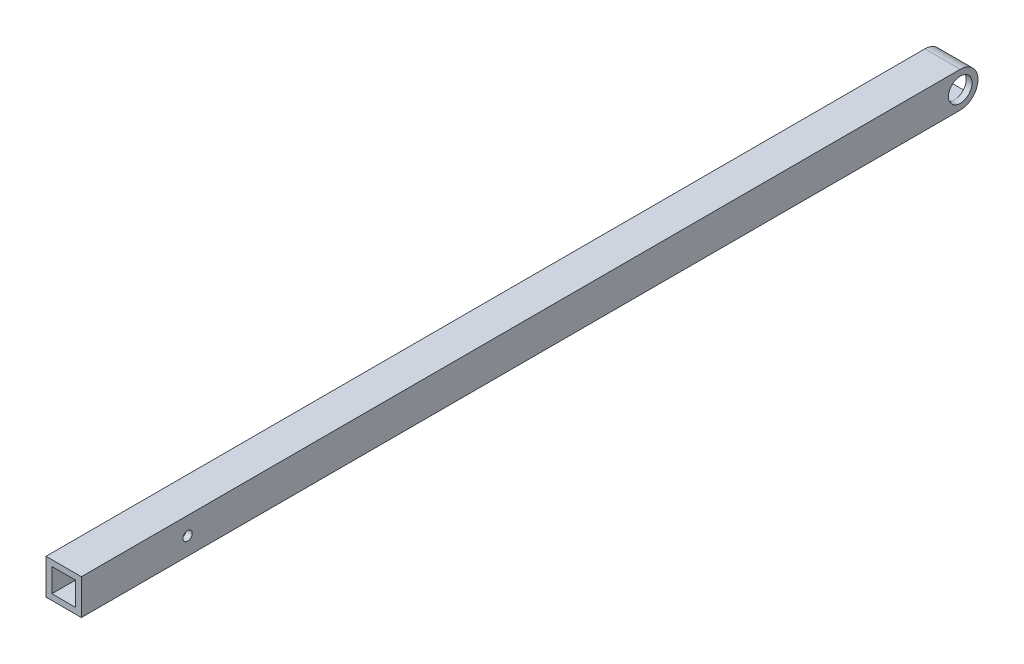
ISO-10303-21;
HEADER;
FILE_DESCRIPTION(('STEP AP214'),'2;1');
FILE_NAME('part.step','',(''),(''),'','','');
FILE_SCHEMA(('AUTOMOTIVE_DESIGN { 1 0 10303 214 1 1 1 1 }'));
ENDSEC;
DATA;
#1=APPLICATION_CONTEXT('core data for automotive mechanical design processes');
#2=APPLICATION_PROTOCOL_DEFINITION('international standard','automotive_design',2000,#1);
#3=PRODUCT_CONTEXT('',#1,'mechanical');
#4=PRODUCT('Part','Part','',(#3));
#5=PRODUCT_RELATED_PRODUCT_CATEGORY('part','',(#4));
#6=PRODUCT_DEFINITION_FORMATION('','',#4);
#7=PRODUCT_DEFINITION_CONTEXT('part definition',#1,'design');
#8=PRODUCT_DEFINITION('design','',#6,#7);
#9=PRODUCT_DEFINITION_SHAPE('','',#8);
#10=(LENGTH_UNIT() NAMED_UNIT(*) SI_UNIT(.MILLI.,.METRE.));
#11=(NAMED_UNIT(*) PLANE_ANGLE_UNIT() SI_UNIT($,.RADIAN.));
#12=(NAMED_UNIT(*) SI_UNIT($,.STERADIAN.) SOLID_ANGLE_UNIT());
#13=UNCERTAINTY_MEASURE_WITH_UNIT(LENGTH_MEASURE(1.E-05),#10,'distance_accuracy_value','');
#14=(GEOMETRIC_REPRESENTATION_CONTEXT(3) GLOBAL_UNCERTAINTY_ASSIGNED_CONTEXT((#13)) GLOBAL_UNIT_ASSIGNED_CONTEXT((#10,
#11,#12)) REPRESENTATION_CONTEXT('',''));
#15=CARTESIAN_POINT('',(0.,0.,0.));
#16=DIRECTION('',(0.,0.,1.));
#17=DIRECTION('',(1.,0.,0.));
#18=AXIS2_PLACEMENT_3D('',#15,#16,#17);
#19=CARTESIAN_POINT('',(9.525,-9.525,482.6));
#20=DIRECTION('',(-1.,0.,0.));
#21=DIRECTION('',(0.,0.,1.));
#22=AXIS2_PLACEMENT_3D('',#19,#20,#21);
#23=PLANE('',#22);
#24=CARTESIAN_POINT('',(9.525,0.,425.424599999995));
#25=DIRECTION('',(-1.,0.,0.));
#26=DIRECTION('',(0.,0.,1.));
#27=AXIS2_PLACEMENT_3D('',#24,#25,#26);
#28=CIRCLE('',#27,2.48920000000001);
#29=CARTESIAN_POINT('',(9.525,0.,427.913799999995));
#30=VERTEX_POINT('',#29);
#31=EDGE_CURVE('E240',#30,#30,#28,.T.);
#32=ORIENTED_EDGE('',*,*,#31,.T.);
#33=EDGE_LOOP('',(#32));
#34=FACE_BOUND('',#33,.T.);
#35=CARTESIAN_POINT('',(9.525,0.,9.525));
#36=DIRECTION('',(1.,0.,0.));
#37=DIRECTION('',(0.,0.,-1.));
#38=AXIS2_PLACEMENT_3D('',#35,#36,#37);
#39=CIRCLE('',#38,6.35);
#40=CARTESIAN_POINT('',(9.525,0.,3.175));
#41=VERTEX_POINT('',#40);
#42=EDGE_CURVE('E224',#41,#41,#39,.T.);
#43=ORIENTED_EDGE('',*,*,#42,.F.);
#44=EDGE_LOOP('',(#43));
#45=FACE_BOUND('',#44,.T.);
#46=CARTESIAN_POINT('',(9.525,0.,9.52500000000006));
#47=DIRECTION('',(1.,0.,0.));
#48=DIRECTION('',(0.,0.,-1.));
#49=AXIS2_PLACEMENT_3D('',#46,#47,#48);
#50=CIRCLE('',#49,9.525);
#51=CARTESIAN_POINT('',(9.525,9.525,9.52500000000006));
#52=VERTEX_POINT('',#51);
#53=CARTESIAN_POINT('',(9.525,-9.525,9.52500000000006));
#54=VERTEX_POINT('',#53);
#55=EDGE_CURVE('E154',#52,#54,#50,.F.);
#56=ORIENTED_EDGE('',*,*,#55,.F.);
#57=DIRECTION('',(0.,0.,-1.));
#58=VECTOR('',#57,1.);
#59=CARTESIAN_POINT('',(9.525,9.525,482.6));
#60=LINE('',#59,#58);
#61=CARTESIAN_POINT('',(9.525,9.525,482.6));
#62=VERTEX_POINT('',#61);
#63=EDGE_CURVE('E158',#62,#52,#60,.T.);
#64=ORIENTED_EDGE('',*,*,#63,.F.);
#65=DIRECTION('',(0.,1.,0.));
#66=VECTOR('',#65,1.);
#67=CARTESIAN_POINT('',(9.525,-9.525,482.6));
#68=LINE('',#67,#66);
#69=CARTESIAN_POINT('',(9.525,-9.525,482.6));
#70=VERTEX_POINT('',#69);
#71=EDGE_CURVE('E191',#70,#62,#68,.T.);
#72=ORIENTED_EDGE('',*,*,#71,.F.);
#73=DIRECTION('',(0.,0.,-1.));
#74=VECTOR('',#73,1.);
#75=CARTESIAN_POINT('',(9.525,-9.525,482.6));
#76=LINE('',#75,#74);
#77=EDGE_CURVE('E160',#70,#54,#76,.T.);
#78=ORIENTED_EDGE('',*,*,#77,.T.);
#79=EDGE_LOOP('',(#56,#64,#72,#78));
#80=FACE_BOUND('',#79,.T.);
#81=ADVANCED_FACE('F77',(#34,#45,#80),#23,.F.);
#82=CARTESIAN_POINT('',(-9.525,-9.525,482.6));
#83=DIRECTION('',(1.,0.,0.));
#84=DIRECTION('',(0.,0.,-1.));
#85=AXIS2_PLACEMENT_3D('',#82,#83,#84);
#86=PLANE('',#85);
#87=CARTESIAN_POINT('',(-9.525,0.,425.424599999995));
#88=DIRECTION('',(-1.,0.,0.));
#89=DIRECTION('',(0.,0.,1.));
#90=AXIS2_PLACEMENT_3D('',#87,#88,#89);
#91=CIRCLE('',#90,2.48920000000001);
#92=CARTESIAN_POINT('',(-9.525,0.,427.913799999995));
#93=VERTEX_POINT('',#92);
#94=EDGE_CURVE('E237',#93,#93,#91,.T.);
#95=ORIENTED_EDGE('',*,*,#94,.F.);
#96=EDGE_LOOP('',(#95));
#97=FACE_BOUND('',#96,.T.);
#98=CARTESIAN_POINT('',(-9.525,0.,9.525));
#99=DIRECTION('',(1.,0.,0.));
#100=DIRECTION('',(0.,0.,-1.));
#101=AXIS2_PLACEMENT_3D('',#98,#99,#100);
#102=CIRCLE('',#101,6.35);
#103=CARTESIAN_POINT('',(-9.525,0.,3.175));
#104=VERTEX_POINT('',#103);
#105=EDGE_CURVE('E223',#104,#104,#102,.T.);
#106=ORIENTED_EDGE('',*,*,#105,.T.);
#107=EDGE_LOOP('',(#106));
#108=FACE_BOUND('',#107,.T.);
#109=DIRECTION('',(0.,0.,-1.));
#110=VECTOR('',#109,1.);
#111=CARTESIAN_POINT('',(-9.525,9.525,482.6));
#112=LINE('',#111,#110);
#113=CARTESIAN_POINT('',(-9.525,9.525,482.6));
#114=VERTEX_POINT('',#113);
#115=CARTESIAN_POINT('',(-9.525,9.525,9.52500000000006));
#116=VERTEX_POINT('',#115);
#117=EDGE_CURVE('E177',#114,#116,#112,.T.);
#118=ORIENTED_EDGE('',*,*,#117,.T.);
#119=CARTESIAN_POINT('',(-9.525,0.,9.52500000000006));
#120=DIRECTION('',(1.,0.,0.));
#121=DIRECTION('',(0.,0.,-1.));
#122=AXIS2_PLACEMENT_3D('',#119,#120,#121);
#123=CIRCLE('',#122,9.525);
#124=CARTESIAN_POINT('',(-9.525,-9.525,9.52500000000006));
#125=VERTEX_POINT('',#124);
#126=EDGE_CURVE('E163',#116,#125,#123,.F.);
#127=ORIENTED_EDGE('',*,*,#126,.T.);
#128=DIRECTION('',(0.,0.,-1.));
#129=VECTOR('',#128,1.);
#130=CARTESIAN_POINT('',(-9.525,-9.525,482.6));
#131=LINE('',#130,#129);
#132=CARTESIAN_POINT('',(-9.525,-9.525,482.6));
#133=VERTEX_POINT('',#132);
#134=EDGE_CURVE('E180',#133,#125,#131,.T.);
#135=ORIENTED_EDGE('',*,*,#134,.F.);
#136=DIRECTION('',(0.,-1.,0.));
#137=VECTOR('',#136,1.);
#138=CARTESIAN_POINT('',(-9.525,-9.525,482.6));
#139=LINE('',#138,#137);
#140=EDGE_CURVE('E188',#114,#133,#139,.T.);
#141=ORIENTED_EDGE('',*,*,#140,.F.);
#142=EDGE_LOOP('',(#118,#127,#135,#141));
#143=FACE_BOUND('',#142,.T.);
#144=ADVANCED_FACE('F297',(#97,#108,#143),#86,.F.);
#145=CARTESIAN_POINT('',(-6.35,-6.35,482.6));
#146=DIRECTION('',(1.,0.,0.));
#147=DIRECTION('',(0.,0.,-1.));
#148=AXIS2_PLACEMENT_3D('',#145,#146,#147);
#149=PLANE('',#148);
#150=CARTESIAN_POINT('',(-6.35,0.,9.52500000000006));
#151=DIRECTION('',(1.,0.,0.));
#152=DIRECTION('',(0.,0.,-1.));
#153=AXIS2_PLACEMENT_3D('',#150,#151,#152);
#154=CIRCLE('',#153,9.525);
#155=CARTESIAN_POINT('',(-6.35,6.35,2.42548417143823));
#156=VERTEX_POINT('',#155);
#157=CARTESIAN_POINT('',(-6.35,-6.35,2.42548417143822));
#158=VERTEX_POINT('',#157);
#159=EDGE_CURVE('E227',#156,#158,#154,.F.);
#160=ORIENTED_EDGE('',*,*,#159,.F.);
#161=DIRECTION('',(0.,0.,-1.));
#162=VECTOR('',#161,1.);
#163=CARTESIAN_POINT('',(-6.35,6.35,482.6));
#164=LINE('',#163,#162);
#165=CARTESIAN_POINT('',(-6.35,6.35,9.525));
#166=VERTEX_POINT('',#165);
#167=EDGE_CURVE('E208',#166,#156,#164,.T.);
#168=ORIENTED_EDGE('',*,*,#167,.F.);
#169=CARTESIAN_POINT('',(-6.35,0.,9.525));
#170=DIRECTION('',(1.,0.,0.));
#171=DIRECTION('',(0.,0.,-1.));
#172=AXIS2_PLACEMENT_3D('',#169,#170,#171);
#173=CIRCLE('',#172,6.35);
#174=CARTESIAN_POINT('',(-6.35,-6.35,9.52500000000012));
#175=VERTEX_POINT('',#174);
#176=EDGE_CURVE('E218',#175,#166,#173,.T.);
#177=ORIENTED_EDGE('',*,*,#176,.F.);
#178=DIRECTION('',(0.,0.,-1.));
#179=VECTOR('',#178,1.);
#180=CARTESIAN_POINT('',(-6.35,-6.35,482.6));
#181=LINE('',#180,#179);
#182=EDGE_CURVE('E196',#175,#158,#181,.T.);
#183=ORIENTED_EDGE('',*,*,#182,.T.);
#184=EDGE_LOOP('',(#160,#168,#177,#183));
#185=FACE_BOUND('',#184,.T.);
#186=ADVANCED_FACE('F283',(#185),#149,.T.);
#187=CARTESIAN_POINT('',(6.35,-6.35,482.6));
#188=DIRECTION('',(-1.,0.,0.));
#189=DIRECTION('',(0.,-1.,0.));
#190=AXIS2_PLACEMENT_3D('',#187,#188,#189);
#191=PLANE('',#190);
#192=DIRECTION('',(0.,0.,-1.));
#193=VECTOR('',#192,1.);
#194=CARTESIAN_POINT('',(6.35,6.35,482.6));
#195=LINE('',#194,#193);
#196=CARTESIAN_POINT('',(6.35,6.35,9.52500000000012));
#197=VERTEX_POINT('',#196);
#198=CARTESIAN_POINT('',(6.35,6.35,2.42548417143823));
#199=VERTEX_POINT('',#198);
#200=EDGE_CURVE('E204',#197,#199,#195,.T.);
#201=ORIENTED_EDGE('',*,*,#200,.T.);
#202=CARTESIAN_POINT('',(6.35,0.,9.52500000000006));
#203=DIRECTION('',(-1.,0.,0.));
#204=DIRECTION('',(0.,-1.,0.));
#205=AXIS2_PLACEMENT_3D('',#202,#203,#204);
#206=CIRCLE('',#205,9.525);
#207=CARTESIAN_POINT('',(6.35,-6.35,2.42548417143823));
#208=VERTEX_POINT('',#207);
#209=EDGE_CURVE('E85',#208,#199,#206,.F.);
#210=ORIENTED_EDGE('',*,*,#209,.F.);
#211=DIRECTION('',(0.,0.,-1.));
#212=VECTOR('',#211,1.);
#213=CARTESIAN_POINT('',(6.35,-6.35,482.6));
#214=LINE('',#213,#212);
#215=CARTESIAN_POINT('',(6.35,-6.35,9.525));
#216=VERTEX_POINT('',#215);
#217=EDGE_CURVE('E200',#216,#208,#214,.T.);
#218=ORIENTED_EDGE('',*,*,#217,.F.);
#219=CARTESIAN_POINT('',(6.35,0.,9.525));
#220=DIRECTION('',(-1.,0.,0.));
#221=DIRECTION('',(0.,-1.,0.));
#222=AXIS2_PLACEMENT_3D('',#219,#220,#221);
#223=CIRCLE('',#222,6.35);
#224=EDGE_CURVE('E221',#197,#216,#223,.T.);
#225=ORIENTED_EDGE('',*,*,#224,.F.);
#226=EDGE_LOOP('',(#201,#210,#218,#225));
#227=FACE_BOUND('',#226,.T.);
#228=ADVANCED_FACE('F256',(#227),#191,.T.);
#229=CARTESIAN_POINT('',(-9.525,-9.525,482.6));
#230=DIRECTION('',(0.,1.,0.));
#231=DIRECTION('',(0.,0.,1.));
#232=AXIS2_PLACEMENT_3D('',#229,#230,#231);
#233=PLANE('',#232);
#234=DIRECTION('',(1.,0.,0.));
#235=VECTOR('',#234,1.);
#236=CARTESIAN_POINT('',(-9.525,-9.525,9.52500000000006));
#237=LINE('',#236,#235);
#238=EDGE_CURVE('E232',#125,#54,#237,.T.);
#239=ORIENTED_EDGE('',*,*,#238,.T.);
#240=ORIENTED_EDGE('',*,*,#77,.F.);
#241=DIRECTION('',(1.,0.,0.));
#242=VECTOR('',#241,1.);
#243=CARTESIAN_POINT('',(-9.525,-9.525,482.6));
#244=LINE('',#243,#242);
#245=EDGE_CURVE('E186',#133,#70,#244,.T.);
#246=ORIENTED_EDGE('',*,*,#245,.F.);
#247=ORIENTED_EDGE('',*,*,#134,.T.);
#248=EDGE_LOOP('',(#239,#240,#246,#247));
#249=FACE_BOUND('',#248,.T.);
#250=ADVANCED_FACE('F313',(#249),#233,.F.);
#251=CARTESIAN_POINT('',(-6.35,0.,425.424599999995));
#252=DIRECTION('',(1.,0.,0.));
#253=DIRECTION('',(0.,0.,-1.));
#254=AXIS2_PLACEMENT_3D('',#251,#252,#253);
#255=CIRCLE('',#254,2.48920000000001);
#256=CARTESIAN_POINT('',(-6.35,0.,427.913799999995));
#257=VERTEX_POINT('',#256);
#258=EDGE_CURVE('E172',#257,#257,#255,.T.);
#259=ORIENTED_EDGE('',*,*,#258,.F.);
#260=EDGE_LOOP('',(#259));
#261=FACE_BOUND('',#260,.T.);
#262=EDGE_CURVE('E99',#166,#175,#173,.T.);
#263=ORIENTED_EDGE('',*,*,#262,.F.);
#264=CARTESIAN_POINT('',(-6.35,6.35,482.6));
#265=VERTEX_POINT('',#264);
#266=EDGE_CURVE('E205',#265,#166,#164,.T.);
#267=ORIENTED_EDGE('',*,*,#266,.F.);
#268=DIRECTION('',(0.,-1.,0.));
#269=VECTOR('',#268,1.);
#270=CARTESIAN_POINT('',(-6.35,-6.35,482.6));
#271=LINE('',#270,#269);
#272=CARTESIAN_POINT('',(-6.35,-6.35,482.6));
#273=VERTEX_POINT('',#272);
#274=EDGE_CURVE('E216',#265,#273,#271,.T.);
#275=ORIENTED_EDGE('',*,*,#274,.T.);
#276=EDGE_CURVE('E193',#273,#175,#181,.T.);
#277=ORIENTED_EDGE('',*,*,#276,.T.);
#278=EDGE_LOOP('',(#263,#267,#275,#277));
#279=FACE_BOUND('',#278,.T.);
#280=ADVANCED_FACE('F254',(#261,#279),#149,.T.);
#281=CARTESIAN_POINT('',(6.35,0.,425.424599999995));
#282=DIRECTION('',(-1.,0.,0.));
#283=DIRECTION('',(0.,-1.,0.));
#284=AXIS2_PLACEMENT_3D('',#281,#282,#283);
#285=CIRCLE('',#284,2.48920000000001);
#286=CARTESIAN_POINT('',(6.35,0.,427.913799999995));
#287=VERTEX_POINT('',#286);
#288=EDGE_CURVE('E80',#287,#287,#285,.T.);
#289=ORIENTED_EDGE('',*,*,#288,.F.);
#290=EDGE_LOOP('',(#289));
#291=FACE_BOUND('',#290,.T.);
#292=EDGE_CURVE('E220',#216,#197,#223,.T.);
#293=ORIENTED_EDGE('',*,*,#292,.F.);
#294=CARTESIAN_POINT('',(6.35,-6.35,482.6));
#295=VERTEX_POINT('',#294);
#296=EDGE_CURVE('E197',#295,#216,#214,.T.);
#297=ORIENTED_EDGE('',*,*,#296,.F.);
#298=DIRECTION('',(0.,1.,0.));
#299=VECTOR('',#298,1.);
#300=CARTESIAN_POINT('',(6.35,-6.35,482.6));
#301=LINE('',#300,#299);
#302=CARTESIAN_POINT('',(6.35,6.35,482.6));
#303=VERTEX_POINT('',#302);
#304=EDGE_CURVE('E211',#295,#303,#301,.T.);
#305=ORIENTED_EDGE('',*,*,#304,.T.);
#306=EDGE_CURVE('E201',#303,#197,#195,.T.);
#307=ORIENTED_EDGE('',*,*,#306,.T.);
#308=EDGE_LOOP('',(#293,#297,#305,#307));
#309=FACE_BOUND('',#308,.T.);
#310=ADVANCED_FACE('F250',(#291,#309),#191,.T.);
#311=CARTESIAN_POINT('',(0.,0.,482.6));
#312=DIRECTION('',(0.,0.,-1.));
#313=DIRECTION('',(-1.,0.,0.));
#314=AXIS2_PLACEMENT_3D('',#311,#312,#313);
#315=PLANE('',#314);
#316=ORIENTED_EDGE('',*,*,#71,.T.);
#317=DIRECTION('',(-1.,0.,0.));
#318=VECTOR('',#317,1.);
#319=CARTESIAN_POINT('',(-9.525,9.525,482.6));
#320=LINE('',#319,#318);
#321=EDGE_CURVE('E175',#62,#114,#320,.T.);
#322=ORIENTED_EDGE('',*,*,#321,.T.);
#323=ORIENTED_EDGE('',*,*,#140,.T.);
#324=ORIENTED_EDGE('',*,*,#245,.T.);
#325=EDGE_LOOP('',(#316,#322,#323,#324));
#326=FACE_BOUND('',#325,.T.);
#327=ORIENTED_EDGE('',*,*,#274,.F.);
#328=DIRECTION('',(-1.,0.,0.));
#329=VECTOR('',#328,1.);
#330=CARTESIAN_POINT('',(-6.35,6.35,482.6));
#331=LINE('',#330,#329);
#332=EDGE_CURVE('E209',#303,#265,#331,.T.);
#333=ORIENTED_EDGE('',*,*,#332,.F.);
#334=ORIENTED_EDGE('',*,*,#304,.F.);
#335=DIRECTION('',(1.,0.,0.));
#336=VECTOR('',#335,1.);
#337=CARTESIAN_POINT('',(-6.35,-6.35,482.6));
#338=LINE('',#337,#336);
#339=EDGE_CURVE('E214',#273,#295,#338,.T.);
#340=ORIENTED_EDGE('',*,*,#339,.F.);
#341=EDGE_LOOP('',(#327,#333,#334,#340));
#342=FACE_BOUND('',#341,.T.);
#343=ADVANCED_FACE('F253',(#326,#342),#315,.F.);
#344=CARTESIAN_POINT('',(-9.525,9.525,482.6));
#345=DIRECTION('',(0.,-1.,0.));
#346=DIRECTION('',(0.,0.,-1.));
#347=AXIS2_PLACEMENT_3D('',#344,#345,#346);
#348=PLANE('',#347);
#349=ORIENTED_EDGE('',*,*,#63,.T.);
#350=DIRECTION('',(1.,0.,0.));
#351=VECTOR('',#350,1.);
#352=CARTESIAN_POINT('',(-9.525,9.525,9.52500000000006));
#353=LINE('',#352,#351);
#354=EDGE_CURVE('E164',#116,#52,#353,.T.);
#355=ORIENTED_EDGE('',*,*,#354,.F.);
#356=ORIENTED_EDGE('',*,*,#117,.F.);
#357=ORIENTED_EDGE('',*,*,#321,.F.);
#358=EDGE_LOOP('',(#349,#355,#356,#357));
#359=FACE_BOUND('',#358,.T.);
#360=ADVANCED_FACE('F174',(#359),#348,.F.);
#361=CARTESIAN_POINT('',(-6.35,-6.35,482.6));
#362=DIRECTION('',(0.,1.,0.));
#363=DIRECTION('',(-1.,0.,0.));
#364=AXIS2_PLACEMENT_3D('',#361,#362,#363);
#365=PLANE('',#364);
#366=DIRECTION('',(1.,0.,0.));
#367=VECTOR('',#366,1.);
#368=CARTESIAN_POINT('',(-9.525,-6.35,2.42548417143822));
#369=LINE('',#368,#367);
#370=EDGE_CURVE('E92',#158,#208,#369,.T.);
#371=ORIENTED_EDGE('',*,*,#370,.F.);
#372=ORIENTED_EDGE('',*,*,#182,.F.);
#373=ORIENTED_EDGE('',*,*,#276,.F.);
#374=ORIENTED_EDGE('',*,*,#339,.T.);
#375=ORIENTED_EDGE('',*,*,#296,.T.);
#376=ORIENTED_EDGE('',*,*,#217,.T.);
#377=EDGE_LOOP('',(#371,#372,#373,#374,#375,#376));
#378=FACE_BOUND('',#377,.T.);
#379=ADVANCED_FACE('F268',(#378),#365,.T.);
#380=CARTESIAN_POINT('',(-6.35,6.35,482.6));
#381=DIRECTION('',(0.,-1.,0.));
#382=DIRECTION('',(0.,0.,-1.));
#383=AXIS2_PLACEMENT_3D('',#380,#381,#382);
#384=PLANE('',#383);
#385=DIRECTION('',(1.,0.,0.));
#386=VECTOR('',#385,1.);
#387=CARTESIAN_POINT('',(-9.525,6.35,2.42548417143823));
#388=LINE('',#387,#386);
#389=EDGE_CURVE('E12',#199,#156,#388,.F.);
#390=ORIENTED_EDGE('',*,*,#389,.F.);
#391=ORIENTED_EDGE('',*,*,#200,.F.);
#392=ORIENTED_EDGE('',*,*,#306,.F.);
#393=ORIENTED_EDGE('',*,*,#332,.T.);
#394=ORIENTED_EDGE('',*,*,#266,.T.);
#395=ORIENTED_EDGE('',*,*,#167,.T.);
#396=EDGE_LOOP('',(#390,#391,#392,#393,#394,#395));
#397=FACE_BOUND('',#396,.T.);
#398=ADVANCED_FACE('F278',(#397),#384,.T.);
#399=CARTESIAN_POINT('',(-9.525,0.,9.525));
#400=DIRECTION('',(1.,0.,0.));
#401=DIRECTION('',(0.,0.,-1.));
#402=AXIS2_PLACEMENT_3D('',#399,#400,#401);
#403=CYLINDRICAL_SURFACE('',#402,6.35);
#404=ORIENTED_EDGE('',*,*,#292,.T.);
#405=ORIENTED_EDGE('',*,*,#224,.T.);
#406=EDGE_LOOP('',(#404,#405));
#407=FACE_BOUND('',#406,.T.);
#408=ORIENTED_EDGE('',*,*,#42,.T.);
#409=EDGE_LOOP('',(#408));
#410=FACE_BOUND('',#409,.T.);
#411=ADVANCED_FACE('F294',(#407,#410),#403,.F.);
#412=ORIENTED_EDGE('',*,*,#262,.T.);
#413=ORIENTED_EDGE('',*,*,#176,.T.);
#414=EDGE_LOOP('',(#412,#413));
#415=FACE_BOUND('',#414,.T.);
#416=ORIENTED_EDGE('',*,*,#105,.F.);
#417=EDGE_LOOP('',(#416));
#418=FACE_BOUND('',#417,.T.);
#419=ADVANCED_FACE('F286',(#415,#418),#403,.F.);
#420=CARTESIAN_POINT('',(-9.525,0.,9.52500000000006));
#421=DIRECTION('',(1.,0.,0.));
#422=DIRECTION('',(0.,0.,-1.));
#423=AXIS2_PLACEMENT_3D('',#420,#421,#422);
#424=CYLINDRICAL_SURFACE('',#423,9.525);
#425=ORIENTED_EDGE('',*,*,#389,.T.);
#426=ORIENTED_EDGE('',*,*,#159,.T.);
#427=ORIENTED_EDGE('',*,*,#370,.T.);
#428=ORIENTED_EDGE('',*,*,#209,.T.);
#429=EDGE_LOOP('',(#425,#426,#427,#428));
#430=FACE_BOUND('',#429,.T.);
#431=ORIENTED_EDGE('',*,*,#126,.F.);
#432=ORIENTED_EDGE('',*,*,#354,.T.);
#433=ORIENTED_EDGE('',*,*,#55,.T.);
#434=ORIENTED_EDGE('',*,*,#238,.F.);
#435=EDGE_LOOP('',(#431,#432,#433,#434));
#436=FACE_BOUND('',#435,.T.);
#437=ADVANCED_FACE('F167',(#430,#436),#424,.T.);
#438=CARTESIAN_POINT('',(9.525,0.,425.424599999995));
#439=DIRECTION('',(-1.,0.,0.));
#440=DIRECTION('',(0.,0.,1.));
#441=AXIS2_PLACEMENT_3D('',#438,#439,#440);
#442=CYLINDRICAL_SURFACE('',#441,2.48920000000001);
#443=CARTESIAN_POINT('',(6.35,0.,427.913799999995));
#444=CARTESIAN_POINT('',(6.38307291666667,0.,427.913799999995));
#445=CARTESIAN_POINT('',(6.41614583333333,0.,427.913799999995));
#446=CARTESIAN_POINT('',(6.48229166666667,0.,427.913799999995));
#447=CARTESIAN_POINT('',(6.51536458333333,0.,427.913799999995));
#448=CARTESIAN_POINT('',(6.58151041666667,0.,427.913799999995));
#449=CARTESIAN_POINT('',(6.61458333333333,0.,427.913799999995));
#450=CARTESIAN_POINT('',(6.68072916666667,0.,427.913799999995));
#451=CARTESIAN_POINT('',(6.71380208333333,0.,427.913799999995));
#452=CARTESIAN_POINT('',(6.77994791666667,0.,427.913799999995));
#453=CARTESIAN_POINT('',(6.81302083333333,0.,427.913799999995));
#454=CARTESIAN_POINT('',(6.87916666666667,0.,427.913799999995));
#455=CARTESIAN_POINT('',(6.91223958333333,0.,427.913799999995));
#456=CARTESIAN_POINT('',(6.97838541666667,0.,427.913799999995));
#457=CARTESIAN_POINT('',(7.01145833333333,0.,427.913799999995));
#458=CARTESIAN_POINT('',(7.07760416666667,0.,427.913799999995));
#459=CARTESIAN_POINT('',(7.11067708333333,0.,427.913799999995));
#460=CARTESIAN_POINT('',(7.17682291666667,0.,427.913799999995));
#461=CARTESIAN_POINT('',(7.20989583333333,0.,427.913799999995));
#462=CARTESIAN_POINT('',(7.27604166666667,0.,427.913799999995));
#463=CARTESIAN_POINT('',(7.30911458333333,0.,427.913799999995));
#464=CARTESIAN_POINT('',(7.37526041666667,0.,427.913799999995));
#465=CARTESIAN_POINT('',(7.40833333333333,0.,427.913799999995));
#466=CARTESIAN_POINT('',(7.47447916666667,0.,427.913799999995));
#467=CARTESIAN_POINT('',(7.50755208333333,0.,427.913799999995));
#468=CARTESIAN_POINT('',(7.57369791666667,0.,427.913799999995));
#469=CARTESIAN_POINT('',(7.60677083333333,0.,427.913799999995));
#470=CARTESIAN_POINT('',(7.67291666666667,0.,427.913799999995));
#471=CARTESIAN_POINT('',(7.70598958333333,0.,427.913799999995));
#472=CARTESIAN_POINT('',(7.77213541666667,0.,427.913799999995));
#473=CARTESIAN_POINT('',(7.80520833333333,0.,427.913799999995));
#474=CARTESIAN_POINT('',(7.87135416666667,0.,427.913799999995));
#475=CARTESIAN_POINT('',(7.90442708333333,0.,427.913799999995));
#476=CARTESIAN_POINT('',(7.97057291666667,0.,427.913799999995));
#477=CARTESIAN_POINT('',(8.00364583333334,0.,427.913799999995));
#478=CARTESIAN_POINT('',(8.06979166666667,0.,427.913799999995));
#479=CARTESIAN_POINT('',(8.10286458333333,0.,427.913799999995));
#480=CARTESIAN_POINT('',(8.16901041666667,0.,427.913799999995));
#481=CARTESIAN_POINT('',(8.20208333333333,0.,427.913799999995));
#482=CARTESIAN_POINT('',(8.26822916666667,0.,427.913799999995));
#483=CARTESIAN_POINT('',(8.30130208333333,0.,427.913799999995));
#484=CARTESIAN_POINT('',(8.36744791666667,0.,427.913799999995));
#485=CARTESIAN_POINT('',(8.40052083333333,0.,427.913799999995));
#486=CARTESIAN_POINT('',(8.46666666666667,0.,427.913799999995));
#487=CARTESIAN_POINT('',(8.49973958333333,0.,427.913799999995));
#488=CARTESIAN_POINT('',(8.56588541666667,0.,427.913799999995));
#489=CARTESIAN_POINT('',(8.59895833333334,0.,427.913799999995));
#490=CARTESIAN_POINT('',(8.66510416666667,0.,427.913799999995));
#491=CARTESIAN_POINT('',(8.69817708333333,0.,427.913799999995));
#492=CARTESIAN_POINT('',(8.76432291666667,0.,427.913799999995));
#493=CARTESIAN_POINT('',(8.79739583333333,0.,427.913799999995));
#494=CARTESIAN_POINT('',(8.86354166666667,0.,427.913799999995));
#495=CARTESIAN_POINT('',(8.89661458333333,0.,427.913799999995));
#496=CARTESIAN_POINT('',(8.96276041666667,0.,427.913799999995));
#497=CARTESIAN_POINT('',(8.99583333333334,0.,427.913799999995));
#498=CARTESIAN_POINT('',(9.06197916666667,0.,427.913799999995));
#499=CARTESIAN_POINT('',(9.09505208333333,0.,427.913799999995));
#500=CARTESIAN_POINT('',(9.16119791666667,0.,427.913799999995));
#501=CARTESIAN_POINT('',(9.19427083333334,0.,427.913799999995));
#502=CARTESIAN_POINT('',(9.26041666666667,0.,427.913799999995));
#503=CARTESIAN_POINT('',(9.29348958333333,0.,427.913799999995));
#504=CARTESIAN_POINT('',(9.35963541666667,0.,427.913799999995));
#505=CARTESIAN_POINT('',(9.39270833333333,0.,427.913799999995));
#506=CARTESIAN_POINT('',(9.45885416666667,0.,427.913799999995));
#507=CARTESIAN_POINT('',(9.49192708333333,0.,427.913799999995));
#508=CARTESIAN_POINT('',(9.525,0.,427.913799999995));
#509=B_SPLINE_CURVE_WITH_KNOTS('',3,(#443,#444,#445,#446,#447,#448,#449,#450,#451,#452,#453,
#454,#455,#456,#457,#458,#459,#460,#461,#462,#463,#464,#465,#466,#467,#468,#469,#470,#471,#472,
#473,#474,#475,#476,#477,#478,#479,#480,#481,#482,#483,#484,#485,#486,#487,#488,#489,#490,#491,
#492,#493,#494,#495,#496,#497,#498,#499,#500,#501,#502,#503,#504,#505,#506,#507,#508),
.UNSPECIFIED.,.F.,.F.,(4,2,2,2,2,2,2,2,2,2,2,2,2,2,2,2,2,2,2,2,2,2,2,2,2,2,2,2,2,2,2,2,4),(0.,
0.0992187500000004,0.198437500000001,0.29765625,0.396875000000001,0.496093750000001,0.5953125,
0.694531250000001,0.793750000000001,0.892968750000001,0.992187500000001,1.09140625,1.190625,
1.28984375,1.3890625,1.48828125,1.5875,1.68671875,1.7859375,1.88515625,1.984375,2.08359375,
2.1828125,2.28203125,2.38125,2.48046875,2.5796875,2.67890625,2.778125,2.87734375,2.9765625,
3.07578125,3.175),.UNSPECIFIED.);
#510=EDGE_CURVE('BSEAM247',#287,#30,#509,.T.);
#511=ORIENTED_EDGE('',*,*,#288,.T.);
#512=ORIENTED_EDGE('',*,*,#31,.F.);
#513=ORIENTED_EDGE('',*,*,#510,.T.);
#514=ORIENTED_EDGE('',*,*,#510,.F.);
#515=EDGE_LOOP('',(#511,#513,#512,#514));
#516=FACE_BOUND('',#515,.T.);
#517=ADVANCED_FACE('F247',(#516),#442,.F.);
#518=CARTESIAN_POINT('',(-6.35,0.,427.913799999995));
#519=CARTESIAN_POINT('',(-6.38307291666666,0.,427.913799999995));
#520=CARTESIAN_POINT('',(-6.41614583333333,0.,427.913799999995));
#521=CARTESIAN_POINT('',(-6.48229166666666,0.,427.913799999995));
#522=CARTESIAN_POINT('',(-6.51536458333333,0.,427.913799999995));
#523=CARTESIAN_POINT('',(-6.58151041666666,0.,427.913799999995));
#524=CARTESIAN_POINT('',(-6.61458333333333,0.,427.913799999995));
#525=CARTESIAN_POINT('',(-6.68072916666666,0.,427.913799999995));
#526=CARTESIAN_POINT('',(-6.71380208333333,0.,427.913799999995));
#527=CARTESIAN_POINT('',(-6.77994791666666,0.,427.913799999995));
#528=CARTESIAN_POINT('',(-6.81302083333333,0.,427.913799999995));
#529=CARTESIAN_POINT('',(-6.87916666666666,0.,427.913799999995));
#530=CARTESIAN_POINT('',(-6.91223958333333,0.,427.913799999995));
#531=CARTESIAN_POINT('',(-6.97838541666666,0.,427.913799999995));
#532=CARTESIAN_POINT('',(-7.01145833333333,0.,427.913799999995));
#533=CARTESIAN_POINT('',(-7.07760416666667,0.,427.913799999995));
#534=CARTESIAN_POINT('',(-7.11067708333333,0.,427.913799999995));
#535=CARTESIAN_POINT('',(-7.17682291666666,0.,427.913799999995));
#536=CARTESIAN_POINT('',(-7.20989583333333,0.,427.913799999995));
#537=CARTESIAN_POINT('',(-7.27604166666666,0.,427.913799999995));
#538=CARTESIAN_POINT('',(-7.30911458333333,0.,427.913799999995));
#539=CARTESIAN_POINT('',(-7.37526041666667,0.,427.913799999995));
#540=CARTESIAN_POINT('',(-7.40833333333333,0.,427.913799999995));
#541=CARTESIAN_POINT('',(-7.47447916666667,0.,427.913799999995));
#542=CARTESIAN_POINT('',(-7.50755208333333,0.,427.913799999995));
#543=CARTESIAN_POINT('',(-7.57369791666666,0.,427.913799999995));
#544=CARTESIAN_POINT('',(-7.60677083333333,0.,427.913799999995));
#545=CARTESIAN_POINT('',(-7.67291666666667,0.,427.913799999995));
#546=CARTESIAN_POINT('',(-7.70598958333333,0.,427.913799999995));
#547=CARTESIAN_POINT('',(-7.77213541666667,0.,427.913799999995));
#548=CARTESIAN_POINT('',(-7.80520833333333,0.,427.913799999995));
#549=CARTESIAN_POINT('',(-7.87135416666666,0.,427.913799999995));
#550=CARTESIAN_POINT('',(-7.90442708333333,0.,427.913799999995));
#551=CARTESIAN_POINT('',(-7.97057291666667,0.,427.913799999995));
#552=CARTESIAN_POINT('',(-8.00364583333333,0.,427.913799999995));
#553=CARTESIAN_POINT('',(-8.06979166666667,0.,427.913799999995));
#554=CARTESIAN_POINT('',(-8.10286458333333,0.,427.913799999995));
#555=CARTESIAN_POINT('',(-8.16901041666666,0.,427.913799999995));
#556=CARTESIAN_POINT('',(-8.20208333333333,0.,427.913799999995));
#557=CARTESIAN_POINT('',(-8.26822916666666,0.,427.913799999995));
#558=CARTESIAN_POINT('',(-8.30130208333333,0.,427.913799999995));
#559=CARTESIAN_POINT('',(-8.36744791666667,0.,427.913799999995));
#560=CARTESIAN_POINT('',(-8.40052083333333,0.,427.913799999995));
#561=CARTESIAN_POINT('',(-8.46666666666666,0.,427.913799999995));
#562=CARTESIAN_POINT('',(-8.49973958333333,0.,427.913799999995));
#563=CARTESIAN_POINT('',(-8.56588541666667,0.,427.913799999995));
#564=CARTESIAN_POINT('',(-8.59895833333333,0.,427.913799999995));
#565=CARTESIAN_POINT('',(-8.66510416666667,0.,427.913799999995));
#566=CARTESIAN_POINT('',(-8.69817708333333,0.,427.913799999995));
#567=CARTESIAN_POINT('',(-8.76432291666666,0.,427.913799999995));
#568=CARTESIAN_POINT('',(-8.79739583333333,0.,427.913799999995));
#569=CARTESIAN_POINT('',(-8.86354166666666,0.,427.913799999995));
#570=CARTESIAN_POINT('',(-8.89661458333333,0.,427.913799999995));
#571=CARTESIAN_POINT('',(-8.96276041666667,0.,427.913799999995));
#572=CARTESIAN_POINT('',(-8.99583333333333,0.,427.913799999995));
#573=CARTESIAN_POINT('',(-9.06197916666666,0.,427.913799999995));
#574=CARTESIAN_POINT('',(-9.09505208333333,0.,427.913799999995));
#575=CARTESIAN_POINT('',(-9.16119791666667,0.,427.913799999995));
#576=CARTESIAN_POINT('',(-9.19427083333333,0.,427.913799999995));
#577=CARTESIAN_POINT('',(-9.26041666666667,0.,427.913799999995));
#578=CARTESIAN_POINT('',(-9.29348958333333,0.,427.913799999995));
#579=CARTESIAN_POINT('',(-9.35963541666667,0.,427.913799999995));
#580=CARTESIAN_POINT('',(-9.39270833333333,0.,427.913799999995));
#581=CARTESIAN_POINT('',(-9.45885416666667,0.,427.913799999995));
#582=CARTESIAN_POINT('',(-9.49192708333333,0.,427.913799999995));
#583=CARTESIAN_POINT('',(-9.525,0.,427.913799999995));
#584=B_SPLINE_CURVE_WITH_KNOTS('',3,(#518,#519,#520,#521,#522,#523,#524,#525,#526,#527,#528,
#529,#530,#531,#532,#533,#534,#535,#536,#537,#538,#539,#540,#541,#542,#543,#544,#545,#546,#547,
#548,#549,#550,#551,#552,#553,#554,#555,#556,#557,#558,#559,#560,#561,#562,#563,#564,#565,#566,
#567,#568,#569,#570,#571,#572,#573,#574,#575,#576,#577,#578,#579,#580,#581,#582,#583),
.UNSPECIFIED.,.F.,.F.,(4,2,2,2,2,2,2,2,2,2,2,2,2,2,2,2,2,2,2,2,2,2,2,2,2,2,2,2,2,2,2,2,4),(0.,
0.0992187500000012,0.198437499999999,0.29765625,0.396875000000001,0.496093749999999,0.5953125,
0.694531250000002,0.793750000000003,0.892968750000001,0.992187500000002,1.09140625,1.190625,
1.28984375,1.3890625,1.48828125,1.5875,1.68671875,1.7859375,1.88515625,1.984375,2.08359375,
2.1828125,2.28203125,2.38125,2.48046875,2.5796875,2.67890625,2.778125,2.87734375,
2.97656250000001,3.07578125,3.175),.UNSPECIFIED.);
#585=EDGE_CURVE('BSEAM292',#257,#93,#584,.T.);
#586=ORIENTED_EDGE('',*,*,#258,.T.);
#587=ORIENTED_EDGE('',*,*,#94,.T.);
#588=ORIENTED_EDGE('',*,*,#585,.T.);
#589=ORIENTED_EDGE('',*,*,#585,.F.);
#590=EDGE_LOOP('',(#586,#588,#587,#589));
#591=FACE_BOUND('',#590,.T.);
#592=ADVANCED_FACE('F292',(#591),#442,.F.);
#593=CLOSED_SHELL('',(#81,#144,#186,#228,#250,#280,#310,#343,#360,#379,#398,#411,#419,#437,#517,#592));
#594=MANIFOLD_SOLID_BREP('B2',#593);
#595=ADVANCED_BREP_SHAPE_REPRESENTATION('',(#18,#594),#14);
#596=SHAPE_DEFINITION_REPRESENTATION(#9,#595);
ENDSEC;
END-ISO-10303-21;
